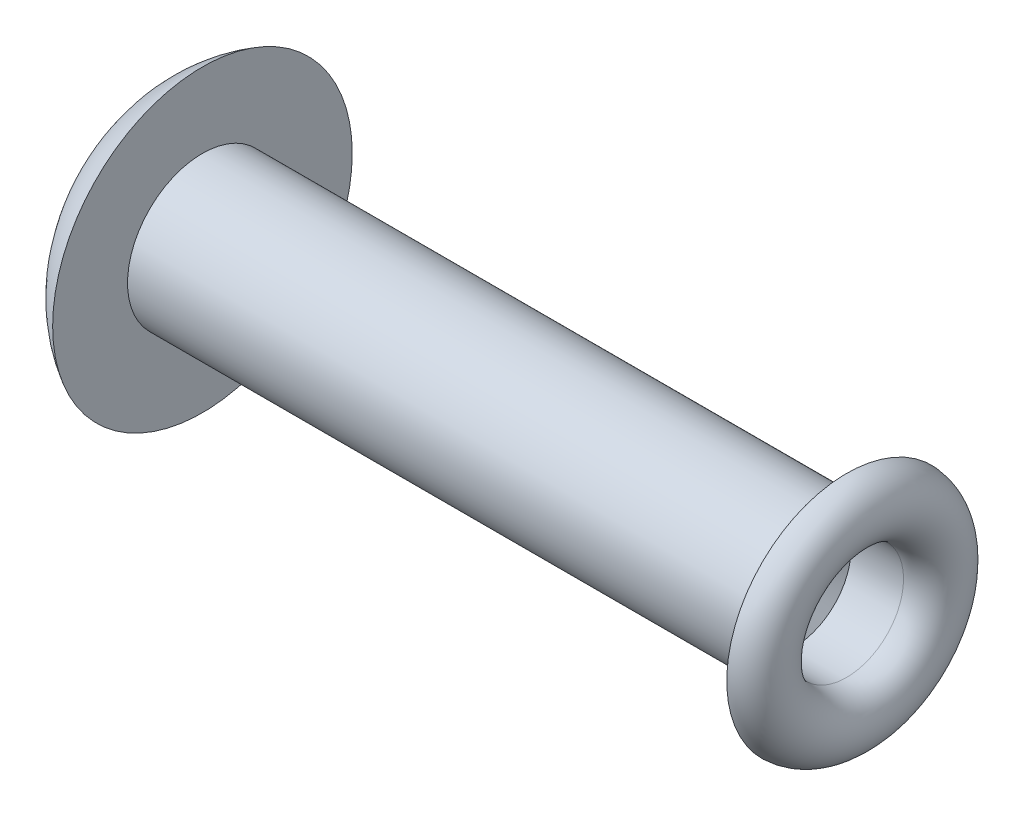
from build123d import *


with BuildPart() as part:
    # Sketch1 → Base-Revolve (revolve)
    with BuildSketch(Plane.XY, mode=Mode.PRIVATE) as base_revolve_sk:
        with BuildLine():
            Line((0, 8), (0, 6.794144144))
            ThreePointArc((0, 6.794144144), (0.796034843, 5.848666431), (-0.1025, 5))
            Line((-0.1025, 5), (-43, 5))
            Line((-43, 5), (-43, 10))
            ThreePointArc((-43, 10), (-46.218807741, 6.847700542), (-47.4, 2.5))
            Line((-47.4, 2.5), (-47.4, 0))
            Line((-47.4, 0), (-5.783270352, 0))
            Line((-5.783270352, 0), (-3.5, 3.8))
            Line((-3.5, 3.8), (0, 3.8))
            ThreePointArc((0, 3.8), (2, 5.9), (0, 8))
        make_face()
    revolve(base_revolve_sk.sketch.rotate(Axis((40.376928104, 0, 0), (-1, 0, 0)), 90), axis=Axis((40.376928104, 0, 0), (-1, 0, 0)))


solid = part.part
